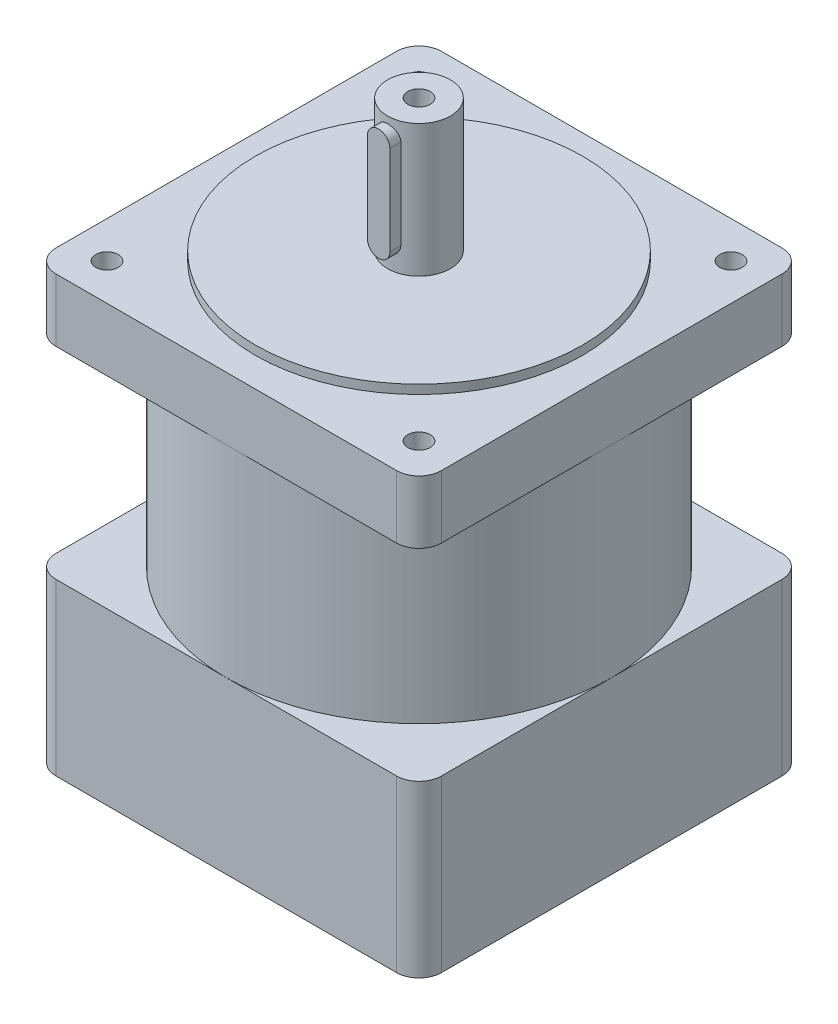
from build123d import *

# Parameters (mm, degrees)
SKETCH_1_W             = 86
SKETCH_1_H             = 86
EXTRUDE_1_DEPTH        = 14
FILLET_1_R             = 5
SKETCH_2_R             = 36.5
EXTRUDE_2_DEPTH        = 2
SKETCH_3_R             = 7
EXTRUDE_3_DEPTH        = 31.5
EXTRUDE_4_DEPTH        = 5
HOLE_WIZARD_M6_1_D     = 5
HOLE_WIZARD_M6_1_DEPTH = 17
HOLE_WIZARD_M6_1_TIP   = 1.502151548
SKETCH_7_R             = 43
EXTRUDE_5_DEPTH        = 45
SKETCH_8_W             = 86
SKETCH_8_H             = 86
EXTRUDE_6_DEPTH        = 38
FILLET_2_R             = 5
SKETCH_9_R             = 36.5
CUT_EXTRUDE_1_DEPTH    = 5
CUT_EXTRUDE_3_DEPTH    = 34
HOLE_WIZARD_M6_2_D     = 5
HOLE_WIZARD_M6_2_DEPTH = 17
HOLE_WIZARD_M6_2_TIP   = 1.502151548
HOLE_WIZARD_M6_3_D     = 5
HOLE_WIZARD_M6_3_DEPTH = 19
HOLE_WIZARD_M6_3_TIP   = 1.502151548


with BuildPart() as part:
    # Sketch 1 → Extrude 1 (new body)
    with BuildSketch(Plane(origin=(0, 0, 0), x_dir=(1, 0, 0), z_dir=(0, 1, 0))):
        Rectangle(SKETCH_1_W, SKETCH_1_H)
    extrude(amount=EXTRUDE_1_DEPTH)

    # Fillet 1
    fillet_1_edges = [part.edges().sort_by_distance(p)[0] for p in [
        (43, 7, 43),
        (-43, 7, 43),
        (-43, 7, -43),
        (43, 7, -43),
    ]]
    fillet(fillet_1_edges, radius=FILLET_1_R)

    # Sketch 2 → Extrude 2 (add)
    with BuildSketch(Plane(origin=(0, 14, 0), x_dir=(1, 0, 0), z_dir=(0, 1, 0))):
        with Locations(Location((0, 0, 0), (0, 0, 270))):
            Circle(SKETCH_2_R)
    extrude(amount=EXTRUDE_2_DEPTH)

    # Sketch 3 → Extrude 3 (add)
    with BuildSketch(Plane(origin=(0, 14, 0), x_dir=(1, 0, 0), z_dir=(0, 1, 0))):
        with Locations(Location((0, 0, 0), (0, 0, 270))):
            Circle(SKETCH_3_R)
    extrude(amount=EXTRUDE_3_DEPTH)

    # Sketch 4 → Extrude 4 (add)
    with BuildSketch(Plane.XY.offset(4)):
        with BuildLine():
            Line((-2.5, 41.5), (-2.5, 21.5))
            ThreePointArc((-2.5, 21.5), (0, 19), (2.5, 21.5))
            Line((2.5, 21.5), (2.5, 41.5))
            ThreePointArc((2.5, 41.5), (0, 44), (-2.5, 41.5))
        make_face()
    extrude(amount=EXTRUDE_4_DEPTH)

    # Hole Wizard M6 _1
    with Locations(Plane(origin=(0, 45.5, 0), x_dir=(1, 0, 0), z_dir=(0, 1, 0))):
        with Locations((0, 0)):
            Hole(HOLE_WIZARD_M6_1_D / 2, depth=HOLE_WIZARD_M6_1_DEPTH)
            with Locations((0, 0, -(HOLE_WIZARD_M6_1_DEPTH + HOLE_WIZARD_M6_1_TIP / 2))):  # 118° drill point
                Cone(0, HOLE_WIZARD_M6_1_D / 2, HOLE_WIZARD_M6_1_TIP, mode=Mode.SUBTRACT)

    # Sketch 7 → Extrude 5 (add)
    with BuildSketch(Plane(origin=(0, 0, 0), x_dir=(1, 0, 0), z_dir=(0, 1, 0))):
        with Locations(Location((0, 0, 0), (0, 0, 270))):
            Circle(SKETCH_7_R)
    extrude(amount=-EXTRUDE_5_DEPTH)

    # Sketch 8 → Extrude 6 (add)
    with BuildSketch(Plane(origin=(0, -45, 0), x_dir=(-1, 0, 0), z_dir=(0, -1, 0))):
        Rectangle(SKETCH_8_W, SKETCH_8_H)
    extrude(amount=EXTRUDE_6_DEPTH)

    # Fillet 2
    fillet_2_edges = [part.edges().sort_by_distance(p)[0] for p in [
        (43, -64, -43),
        (43, -64, 43),
        (-43, -64, 43),
        (-43, -64, -43),
    ]]
    fillet(fillet_2_edges, radius=FILLET_2_R)

    # Sketch 9 → Cut-Extrude 1 (cut)
    with BuildSketch(Plane(origin=(0, -83, 0), x_dir=(-1, 0, 0), z_dir=(0, -1, 0))):
        with Locations(Location((0, 0, 0), (0, 0, 270))):
            Circle(SKETCH_9_R)
    extrude(amount=-CUT_EXTRUDE_1_DEPTH, mode=Mode.SUBTRACT)

    # Sketch 10 → Cut-Extrude 3 (cut)
    with BuildSketch(Plane(origin=(0, -83, 0), x_dir=(-1, 0, 0), z_dir=(0, -1, 0))):
        with BuildLine():
            Line((2.5, -9), (2.5, -6.538348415))
            ThreePointArc((2.5, -6.538348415), (0, 7), (-2.5, -6.538348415))
            Line((-2.5, -6.538348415), (-2.5, -9))
            Line((-2.5, -9), (2.5, -9))
        make_face()
    extrude(amount=-CUT_EXTRUDE_3_DEPTH, mode=Mode.SUBTRACT)

    # Hole Wizard M6 _2
    with Locations(Plane(origin=(0, -83, 0), x_dir=(-1, 0, 0), z_dir=(0, -1, 0))):
        with Locations((34.8, -34.8), (34.8, 34.8), (-34.8, 34.8), (-34.8, -34.8)):
            Hole(HOLE_WIZARD_M6_2_D / 2, depth=HOLE_WIZARD_M6_2_DEPTH)
            with Locations((0, 0, -(HOLE_WIZARD_M6_2_DEPTH + HOLE_WIZARD_M6_2_TIP / 2))):  # 118° drill point
                Cone(0, HOLE_WIZARD_M6_2_D / 2, HOLE_WIZARD_M6_2_TIP, mode=Mode.SUBTRACT)

    # Hole Wizard M6 _3
    with Locations(Plane(origin=(0, 14, 0), x_dir=(1, 0, 0), z_dir=(0, 1, 0))):
        with Locations((-34.8, 34.8), (-34.8, -34.8), (34.8, -34.8), (34.8, 34.8)):
            Hole(HOLE_WIZARD_M6_3_D / 2, depth=HOLE_WIZARD_M6_3_DEPTH)
            with Locations((0, 0, -(HOLE_WIZARD_M6_3_DEPTH + HOLE_WIZARD_M6_3_TIP / 2))):  # 118° drill point
                Cone(0, HOLE_WIZARD_M6_3_D / 2, HOLE_WIZARD_M6_3_TIP, mode=Mode.SUBTRACT)


solid = part.part
